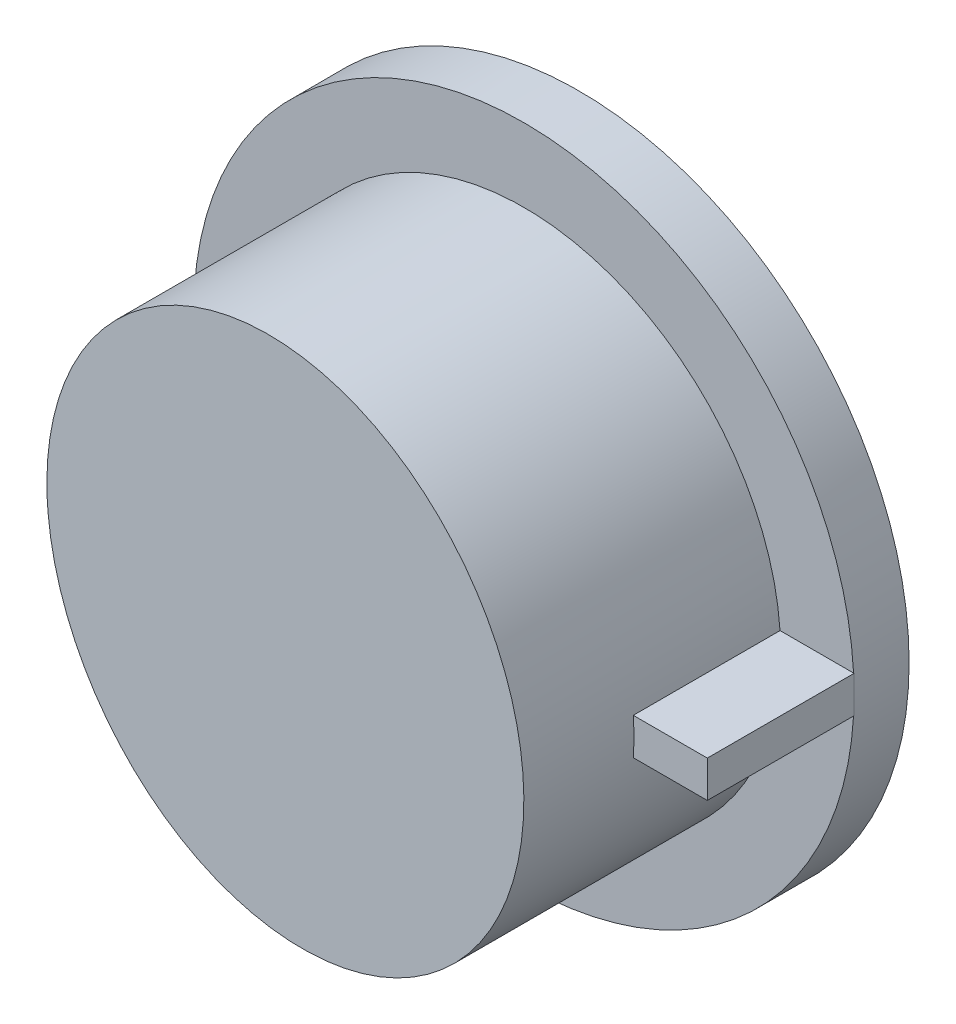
from build123d import *

# Parameters (mm, degrees)
ESQUISSE1_R             = 9
EXTRUSION1_DEPTH        = 1.5
ESQUISSE2_R             = 7
EXTRUSION2_DEPTH        = 8
ENL_V_MAT_EXTRU_1_DEPTH = 9
ESQUISSE4_R             = 6
ENL_V_MAT_EXTRU_2_DEPTH = 6
ESQUISSE5_W             = 2.615409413
ESQUISSE5_H             = 4
EXTRUSION3_DEPTH        = 0.5


with BuildPart() as part:
    # Esquisse1 → Extrusion1 (new body)
    with BuildSketch(Plane.XY):
        Circle(ESQUISSE1_R)
    extrude(amount=EXTRUSION1_DEPTH)

    # Esquisse2 → Extrusion2 (add)
    with BuildSketch(Plane.XY.offset(1.5)):
        Circle(ESQUISSE2_R)
    extrude(amount=EXTRUSION2_DEPTH)

    # Esquisse3 → Enl_v. mat.-Extru.1 (cut, symmetric)
    with BuildSketch(Plane(origin=(0, 0, 0), x_dir=(1, 0, 0), z_dir=(0, 1, 0))):
        Polygon((-7, -7.5), (7, -8.5), (7, -11.847034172), (-7, -11.847034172), align=None)
    extrude(amount=ENL_V_MAT_EXTRU_1_DEPTH, both=True, mode=Mode.SUBTRACT)

    # Esquisse4 → Enl_v. mat.-Extru.2 (cut)
    with BuildSketch(Plane(origin=(0, 0, 0), x_dir=(-1, 0, 0), z_dir=(0, 0, -1))):
        Circle(ESQUISSE4_R)
    extrude(amount=-ENL_V_MAT_EXTRU_2_DEPTH, mode=Mode.SUBTRACT)

    # Esquisse5 → Extrusion3 (add, symmetric)
    with BuildSketch(Plane(origin=(0, 0, 0), x_dir=(1, 0, 0), z_dir=(0, 1, 0))):
        with Locations((7.692295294, -3.5)):
            Rectangle(ESQUISSE5_W, ESQUISSE5_H)
    extrude(amount=EXTRUSION3_DEPTH, both=True)


solid = part.part
